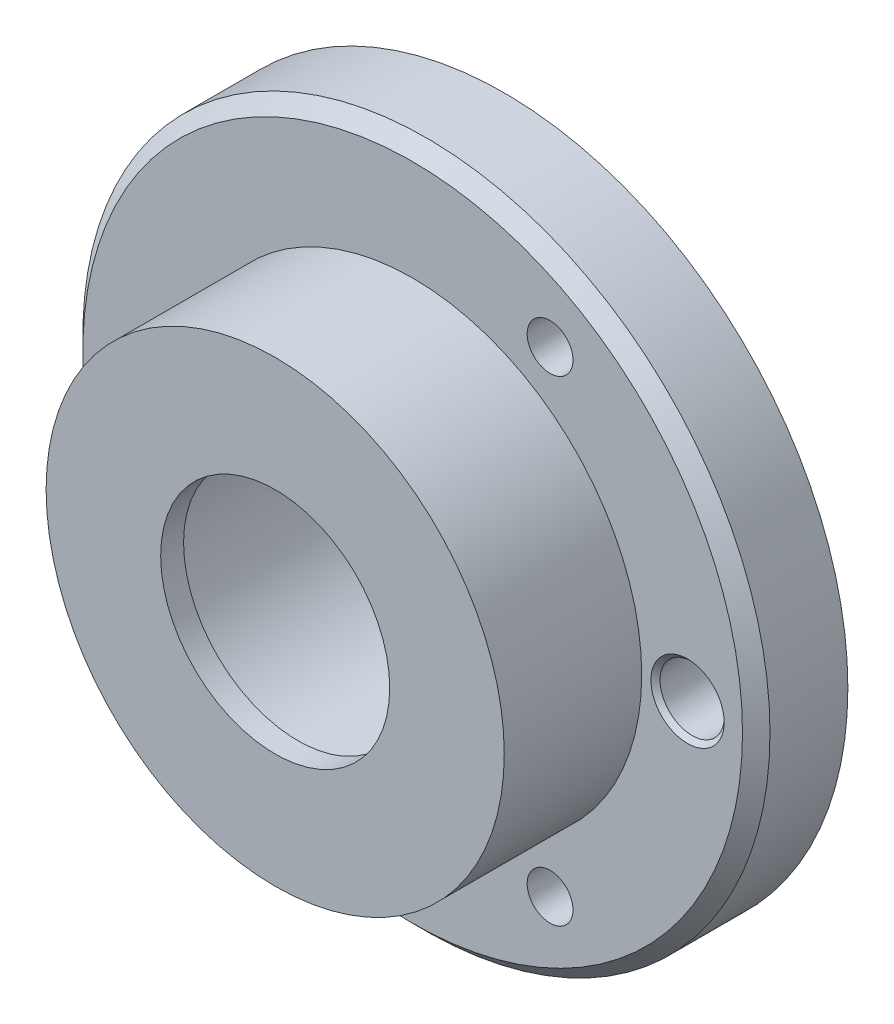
from build123d import *

# Parameters (mm, degrees)
SKIZZE1_R                       = 7.5
LINEAR_AUSTRAGEN1_DEPTH         = 2
SKIZZE2_R                       = 5
LINEAR_AUSTRAGEN2_DEPTH         = 3
SCHNITT_LINEAR_AUSTRAGEN1_REACH = 13.726
SKIZZE3_R                       = 2.5
SKIZZE4_R                       = 3.05
SCHNITT_LINEAR_AUSTRAGEN2_DEPTH = 4.5
SKIZZE6_R                       = 0.5
SCHNITT_LINEAR_AUSTRAGEN4_DEPTH = 12.7260394
SKIZZE5_R                       = 0.7
SCHNITT_LINEAR_AUSTRAGEN3_DEPTH = 12.7260394
FASE1_SIZE                      = 0.3
FASE2_SIZE                      = 0.3
FASE2_SIZE2                     = 0.519615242
FASE3_SIZE                      = 0.1


with BuildPart() as part:
    # Skizze1 → Linear austragen1 (new body)
    with BuildSketch(Plane.XY):
        Circle(SKIZZE1_R)
    extrude(amount=LINEAR_AUSTRAGEN1_DEPTH)

    # Skizze2 → Linear austragen2 (add)
    with BuildSketch(Plane.XY.offset(2)):
        Circle(SKIZZE2_R)
    extrude(amount=LINEAR_AUSTRAGEN2_DEPTH)

    # Skizze3 → Schnitt-Linear austragen1 (cut, up to next)
    with BuildSketch(Plane.XY.offset(5), mode=Mode.PRIVATE) as schnitt_linear_austragen1_sk1:
        Circle(SKIZZE3_R)
    schnitt_linear_austragen1_tool1 = extrude(schnitt_linear_austragen1_sk1.sketch, amount=-SCHNITT_LINEAR_AUSTRAGEN1_REACH, mode=Mode.PRIVATE) & part.part
    add(schnitt_linear_austragen1_tool1.solids().sort_by_distance((0, 0, 5))[0], mode=Mode.SUBTRACT)

    # Skizze4 → Schnitt-Linear austragen2 (cut)
    with BuildSketch(Plane(origin=(0, 0, 0), x_dir=(-1, 0, 0), z_dir=(0, 0, -1))):
        Circle(SKIZZE4_R)
    extrude(amount=-SCHNITT_LINEAR_AUSTRAGEN2_DEPTH, mode=Mode.SUBTRACT)

    # Skizze6 → Schnitt-Linear austragen4 (cut, through all)
    with BuildSketch(Plane(origin=(0, 0, 0), x_dir=(-1, 0, 0), z_dir=(0, 0, -1))):
        with Locations((6, 0)):
            Circle(SKIZZE6_R)
        with Locations((-3, -5.196152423)):
            Circle(SKIZZE6_R)
        with Locations((-3, 5.196152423)):
            Circle(SKIZZE6_R)
    extrude(amount=-SCHNITT_LINEAR_AUSTRAGEN4_DEPTH, mode=Mode.SUBTRACT)

    # Skizze5 → Schnitt-Linear austragen3 (cut, through all)
    with BuildSketch(Plane(origin=(0, 0, 0), x_dir=(-1, 0, 0), z_dir=(0, 0, -1))):
        with Locations((-6, 0)):
            Circle(SKIZZE5_R)
    extrude(amount=-SCHNITT_LINEAR_AUSTRAGEN3_DEPTH, mode=Mode.SUBTRACT)

    # Fase1
    fase1_edges = [part.edges().sort_by_distance(p)[0] for p in [
        (-7.5, 0, 2),
    ]]
    chamfer(fase1_edges, length=FASE1_SIZE)

    # Fase2
    fase2_edges = [part.edges().sort_by_distance(p)[0] for p in [
        (3.05, 0, 0),
    ]]
    fase2_side = [part.faces().sort_by_distance(p)[0] for p in [
        (-7.287867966, 0, 0),
    ]]
    chamfer(fase2_edges, length=FASE2_SIZE, length2=FASE2_SIZE2, reference=fase2_side[0])

    # Fase3
    fase3_edges = [part.edges().sort_by_distance(p)[0] for p in [
        (-5.5, 0, 0),
        (3.5, -5.196152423, 0),
        (3.5, 5.196152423, 0),
        (6.7, 0, 2),
        (6.7, 0, 0),
    ]]
    chamfer(fase3_edges, length=FASE3_SIZE)


solid = part.part
